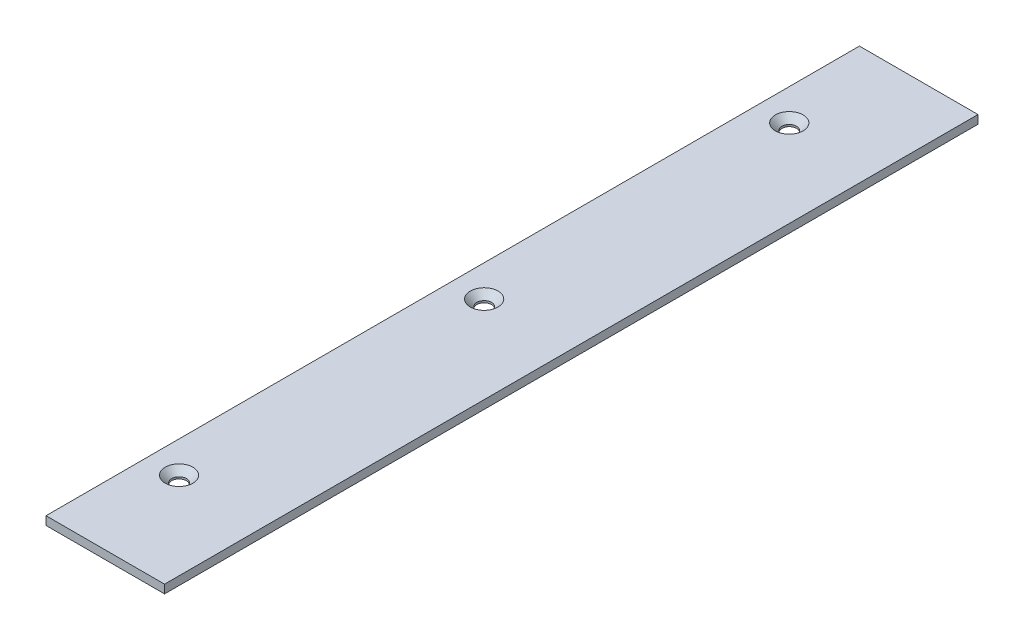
ISO-10303-21;
HEADER;
FILE_DESCRIPTION(('STEP AP214'),'2;1');
FILE_NAME('part.step','',(''),(''),'','','');
FILE_SCHEMA(('AUTOMOTIVE_DESIGN { 1 0 10303 214 1 1 1 1 }'));
ENDSEC;
DATA;
#1=APPLICATION_CONTEXT('core data for automotive mechanical design processes');
#2=APPLICATION_PROTOCOL_DEFINITION('international standard','automotive_design',2000,#1);
#3=PRODUCT_CONTEXT('',#1,'mechanical');
#4=PRODUCT('Part','Part','',(#3));
#5=PRODUCT_RELATED_PRODUCT_CATEGORY('part','',(#4));
#6=PRODUCT_DEFINITION_FORMATION('','',#4);
#7=PRODUCT_DEFINITION_CONTEXT('part definition',#1,'design');
#8=PRODUCT_DEFINITION('design','',#6,#7);
#9=PRODUCT_DEFINITION_SHAPE('','',#8);
#10=(LENGTH_UNIT() NAMED_UNIT(*) SI_UNIT(.MILLI.,.METRE.));
#11=(NAMED_UNIT(*) PLANE_ANGLE_UNIT() SI_UNIT($,.RADIAN.));
#12=(NAMED_UNIT(*) SI_UNIT($,.STERADIAN.) SOLID_ANGLE_UNIT());
#13=UNCERTAINTY_MEASURE_WITH_UNIT(LENGTH_MEASURE(1.E-05),#10,'distance_accuracy_value','');
#14=(GEOMETRIC_REPRESENTATION_CONTEXT(3) GLOBAL_UNCERTAINTY_ASSIGNED_CONTEXT((#13)) GLOBAL_UNIT_ASSIGNED_CONTEXT((#10,
#11,#12)) REPRESENTATION_CONTEXT('',''));
#15=CARTESIAN_POINT('',(0.,0.,0.));
#16=DIRECTION('',(0.,0.,1.));
#17=DIRECTION('',(1.,0.,0.));
#18=AXIS2_PLACEMENT_3D('',#15,#16,#17);
#19=CARTESIAN_POINT('',(-22.225,-1.5875,-152.5));
#20=DIRECTION('',(-1.,0.,0.));
#21=DIRECTION('',(0.,0.,1.));
#22=AXIS2_PLACEMENT_3D('',#19,#20,#21);
#23=PLANE('',#22);
#24=DIRECTION('',(0.,0.,1.));
#25=VECTOR('',#24,1.);
#26=CARTESIAN_POINT('',(-22.225,-1.5875,-152.5));
#27=LINE('',#26,#25);
#28=CARTESIAN_POINT('',(-22.225,-1.5875,-152.5));
#29=VERTEX_POINT('',#28);
#30=CARTESIAN_POINT('',(-22.225,-1.5875,152.5));
#31=VERTEX_POINT('',#30);
#32=EDGE_CURVE('E36',#29,#31,#27,.T.);
#33=ORIENTED_EDGE('',*,*,#32,.T.);
#34=DIRECTION('',(0.,-1.,0.));
#35=VECTOR('',#34,1.);
#36=CARTESIAN_POINT('',(-22.225,-1.5875,152.5));
#37=LINE('',#36,#35);
#38=CARTESIAN_POINT('',(-22.225,1.5875,152.5));
#39=VERTEX_POINT('',#38);
#40=EDGE_CURVE('E73',#39,#31,#37,.T.);
#41=ORIENTED_EDGE('',*,*,#40,.F.);
#42=DIRECTION('',(0.,0.,1.));
#43=VECTOR('',#42,1.);
#44=CARTESIAN_POINT('',(-22.225,1.5875,-152.5));
#45=LINE('',#44,#43);
#46=CARTESIAN_POINT('',(-22.225,1.5875,-152.5));
#47=VERTEX_POINT('',#46);
#48=EDGE_CURVE('E11',#47,#39,#45,.T.);
#49=ORIENTED_EDGE('',*,*,#48,.F.);
#50=DIRECTION('',(0.,-1.,0.));
#51=VECTOR('',#50,1.);
#52=CARTESIAN_POINT('',(-22.225,-1.5875,-152.5));
#53=LINE('',#52,#51);
#54=EDGE_CURVE('E74',#47,#29,#53,.T.);
#55=ORIENTED_EDGE('',*,*,#54,.T.);
#56=EDGE_LOOP('',(#33,#41,#49,#55));
#57=FACE_BOUND('',#56,.T.);
#58=ADVANCED_FACE('F33',(#57),#23,.T.);
#59=CARTESIAN_POINT('',(22.225,1.5875,-152.5));
#60=DIRECTION('',(0.,1.,0.));
#61=DIRECTION('',(-1.,0.,0.));
#62=AXIS2_PLACEMENT_3D('',#59,#60,#61);
#63=PLANE('',#62);
#64=CARTESIAN_POINT('',(-10.4394,1.5875,114.4));
#65=DIRECTION('',(0.,1.,0.));
#66=DIRECTION('',(0.,0.,1.));
#67=AXIS2_PLACEMENT_3D('',#64,#65,#66);
#68=CIRCLE('',#67,5.2);
#69=CARTESIAN_POINT('',(-10.4394,1.5875,119.6));
#70=VERTEX_POINT('',#69);
#71=EDGE_CURVE('E135',#70,#70,#68,.T.);
#72=ORIENTED_EDGE('',*,*,#71,.F.);
#73=EDGE_LOOP('',(#72));
#74=FACE_BOUND('',#73,.T.);
#75=CARTESIAN_POINT('',(-10.4394,1.5875,0.));
#76=DIRECTION('',(0.,1.,0.));
#77=DIRECTION('',(0.,0.,1.));
#78=AXIS2_PLACEMENT_3D('',#75,#76,#77);
#79=CIRCLE('',#78,5.2);
#80=CARTESIAN_POINT('',(-10.4394,1.5875,5.2));
#81=VERTEX_POINT('',#80);
#82=EDGE_CURVE('E139',#81,#81,#79,.T.);
#83=ORIENTED_EDGE('',*,*,#82,.F.);
#84=EDGE_LOOP('',(#83));
#85=FACE_BOUND('',#84,.T.);
#86=CARTESIAN_POINT('',(-10.4394,1.5875,-114.4));
#87=DIRECTION('',(0.,1.,0.));
#88=DIRECTION('',(0.,0.,1.));
#89=AXIS2_PLACEMENT_3D('',#86,#87,#88);
#90=CIRCLE('',#89,5.2);
#91=CARTESIAN_POINT('',(-10.4394,1.5875,-109.2));
#92=VERTEX_POINT('',#91);
#93=EDGE_CURVE('E142',#92,#92,#90,.T.);
#94=ORIENTED_EDGE('',*,*,#93,.F.);
#95=EDGE_LOOP('',(#94));
#96=FACE_BOUND('',#95,.T.);
#97=ORIENTED_EDGE('',*,*,#48,.T.);
#98=DIRECTION('',(-1.,0.,0.));
#99=VECTOR('',#98,1.);
#100=CARTESIAN_POINT('',(22.225,1.5875,152.5));
#101=LINE('',#100,#99);
#102=CARTESIAN_POINT('',(22.225,1.5875,152.5));
#103=VERTEX_POINT('',#102);
#104=EDGE_CURVE('E90',#103,#39,#101,.T.);
#105=ORIENTED_EDGE('',*,*,#104,.F.);
#106=DIRECTION('',(0.,0.,1.));
#107=VECTOR('',#106,1.);
#108=CARTESIAN_POINT('',(22.225,1.5875,-152.5));
#109=LINE('',#108,#107);
#110=CARTESIAN_POINT('',(22.225,1.5875,-152.5));
#111=VERTEX_POINT('',#110);
#112=EDGE_CURVE('E41',#111,#103,#109,.T.);
#113=ORIENTED_EDGE('',*,*,#112,.F.);
#114=DIRECTION('',(-1.,0.,0.));
#115=VECTOR('',#114,1.);
#116=CARTESIAN_POINT('',(22.225,1.5875,-152.5));
#117=LINE('',#116,#115);
#118=EDGE_CURVE('E79',#111,#47,#117,.T.);
#119=ORIENTED_EDGE('',*,*,#118,.T.);
#120=EDGE_LOOP('',(#97,#105,#113,#119));
#121=FACE_BOUND('',#120,.T.);
#122=ADVANCED_FACE('F110',(#74,#85,#96,#121),#63,.T.);
#123=CARTESIAN_POINT('',(22.225,-1.5875,-152.5));
#124=DIRECTION('',(1.,0.,0.));
#125=DIRECTION('',(0.,0.,-1.));
#126=AXIS2_PLACEMENT_3D('',#123,#124,#125);
#127=PLANE('',#126);
#128=ORIENTED_EDGE('',*,*,#112,.T.);
#129=DIRECTION('',(0.,1.,0.));
#130=VECTOR('',#129,1.);
#131=CARTESIAN_POINT('',(22.225,-1.5875,152.5));
#132=LINE('',#131,#130);
#133=CARTESIAN_POINT('',(22.225,-1.5875,152.5));
#134=VERTEX_POINT('',#133);
#135=EDGE_CURVE('E86',#134,#103,#132,.T.);
#136=ORIENTED_EDGE('',*,*,#135,.F.);
#137=DIRECTION('',(0.,0.,1.));
#138=VECTOR('',#137,1.);
#139=CARTESIAN_POINT('',(22.225,-1.5875,-152.5));
#140=LINE('',#139,#138);
#141=CARTESIAN_POINT('',(22.225,-1.5875,-152.5));
#142=VERTEX_POINT('',#141);
#143=EDGE_CURVE('E78',#142,#134,#140,.T.);
#144=ORIENTED_EDGE('',*,*,#143,.F.);
#145=DIRECTION('',(0.,1.,0.));
#146=VECTOR('',#145,1.);
#147=CARTESIAN_POINT('',(22.225,-1.5875,-152.5));
#148=LINE('',#147,#146);
#149=EDGE_CURVE('E103',#142,#111,#148,.T.);
#150=ORIENTED_EDGE('',*,*,#149,.T.);
#151=EDGE_LOOP('',(#128,#136,#144,#150));
#152=FACE_BOUND('',#151,.T.);
#153=ADVANCED_FACE('F107',(#152),#127,.T.);
#154=CARTESIAN_POINT('',(22.225,-1.5875,-152.5));
#155=DIRECTION('',(0.,-1.,0.));
#156=DIRECTION('',(1.,0.,0.));
#157=AXIS2_PLACEMENT_3D('',#154,#155,#156);
#158=PLANE('',#157);
#159=CARTESIAN_POINT('',(-10.4394,-1.58750000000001,114.4));
#160=DIRECTION('',(0.,1.,0.));
#161=DIRECTION('',(0.,0.,1.));
#162=AXIS2_PLACEMENT_3D('',#159,#160,#161);
#163=CIRCLE('',#162,2.75);
#164=CARTESIAN_POINT('',(-10.4394,-1.58750000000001,117.15));
#165=VERTEX_POINT('',#164);
#166=EDGE_CURVE('E154',#165,#165,#163,.T.);
#167=ORIENTED_EDGE('',*,*,#166,.T.);
#168=EDGE_LOOP('',(#167));
#169=FACE_BOUND('',#168,.T.);
#170=CARTESIAN_POINT('',(-10.4394,-1.58750000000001,0.));
#171=DIRECTION('',(0.,1.,0.));
#172=DIRECTION('',(0.,0.,1.));
#173=AXIS2_PLACEMENT_3D('',#170,#171,#172);
#174=CIRCLE('',#173,2.75);
#175=CARTESIAN_POINT('',(-10.4394,-1.58750000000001,2.75));
#176=VERTEX_POINT('',#175);
#177=EDGE_CURVE('E144',#176,#176,#174,.T.);
#178=ORIENTED_EDGE('',*,*,#177,.T.);
#179=EDGE_LOOP('',(#178));
#180=FACE_BOUND('',#179,.T.);
#181=CARTESIAN_POINT('',(-10.4394,-1.58750000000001,-114.4));
#182=DIRECTION('',(0.,1.,0.));
#183=DIRECTION('',(0.,0.,1.));
#184=AXIS2_PLACEMENT_3D('',#181,#182,#183);
#185=CIRCLE('',#184,2.75);
#186=CARTESIAN_POINT('',(-10.4394,-1.58750000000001,-111.65));
#187=VERTEX_POINT('',#186);
#188=EDGE_CURVE('E91',#187,#187,#185,.T.);
#189=ORIENTED_EDGE('',*,*,#188,.T.);
#190=EDGE_LOOP('',(#189));
#191=FACE_BOUND('',#190,.T.);
#192=ORIENTED_EDGE('',*,*,#143,.T.);
#193=DIRECTION('',(1.,0.,0.));
#194=VECTOR('',#193,1.);
#195=CARTESIAN_POINT('',(22.225,-1.5875,152.5));
#196=LINE('',#195,#194);
#197=EDGE_CURVE('E81',#31,#134,#196,.T.);
#198=ORIENTED_EDGE('',*,*,#197,.F.);
#199=ORIENTED_EDGE('',*,*,#32,.F.);
#200=DIRECTION('',(1.,0.,0.));
#201=VECTOR('',#200,1.);
#202=CARTESIAN_POINT('',(22.225,-1.5875,-152.5));
#203=LINE('',#202,#201);
#204=EDGE_CURVE('E101',#29,#142,#203,.T.);
#205=ORIENTED_EDGE('',*,*,#204,.T.);
#206=EDGE_LOOP('',(#192,#198,#199,#205));
#207=FACE_BOUND('',#206,.T.);
#208=ADVANCED_FACE('F82',(#169,#180,#191,#207),#158,.T.);
#209=CARTESIAN_POINT('',(0.,0.,-152.5));
#210=DIRECTION('',(0.,0.,1.));
#211=DIRECTION('',(1.,0.,0.));
#212=AXIS2_PLACEMENT_3D('',#209,#210,#211);
#213=PLANE('',#212);
#214=ORIENTED_EDGE('',*,*,#54,.F.);
#215=ORIENTED_EDGE('',*,*,#118,.F.);
#216=ORIENTED_EDGE('',*,*,#149,.F.);
#217=ORIENTED_EDGE('',*,*,#204,.F.);
#218=EDGE_LOOP('',(#214,#215,#216,#217));
#219=FACE_BOUND('',#218,.T.);
#220=ADVANCED_FACE('F112',(#219),#213,.F.);
#221=CARTESIAN_POINT('',(0.,0.,152.5));
#222=DIRECTION('',(0.,0.,1.));
#223=DIRECTION('',(1.,0.,0.));
#224=AXIS2_PLACEMENT_3D('',#221,#222,#223);
#225=PLANE('',#224);
#226=ORIENTED_EDGE('',*,*,#40,.T.);
#227=ORIENTED_EDGE('',*,*,#197,.T.);
#228=ORIENTED_EDGE('',*,*,#135,.T.);
#229=ORIENTED_EDGE('',*,*,#104,.T.);
#230=EDGE_LOOP('',(#226,#227,#228,#229));
#231=FACE_BOUND('',#230,.T.);
#232=ADVANCED_FACE('F89',(#231),#225,.T.);
#233=CARTESIAN_POINT('',(-10.4394,1.5875,-114.4));
#234=DIRECTION('',(0.,1.,0.));
#235=DIRECTION('',(0.,0.,1.));
#236=AXIS2_PLACEMENT_3D('',#233,#234,#235);
#237=CYLINDRICAL_SURFACE('',#236,2.75);
#238=ORIENTED_EDGE('',*,*,#188,.F.);
#239=EDGE_LOOP('',(#238));
#240=FACE_BOUND('',#239,.T.);
#241=CARTESIAN_POINT('',(-10.4394,-0.862500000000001,-114.4));
#242=DIRECTION('',(0.,1.,0.));
#243=DIRECTION('',(0.,0.,1.));
#244=AXIS2_PLACEMENT_3D('',#241,#242,#243);
#245=CIRCLE('',#244,2.75);
#246=CARTESIAN_POINT('',(-10.4394,-0.862500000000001,-111.65));
#247=VERTEX_POINT('',#246);
#248=EDGE_CURVE('E94',#247,#247,#245,.T.);
#249=ORIENTED_EDGE('',*,*,#248,.T.);
#250=EDGE_LOOP('',(#249));
#251=FACE_BOUND('',#250,.T.);
#252=ADVANCED_FACE('F119',(#240,#251),#237,.F.);
#253=CARTESIAN_POINT('',(-10.4394,1.5875,-114.4));
#254=DIRECTION('',(0.,1.,0.));
#255=DIRECTION('',(0.,0.,1.));
#256=AXIS2_PLACEMENT_3D('',#253,#254,#255);
#257=CONICAL_SURFACE('',#256,5.2,0.785398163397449);
#258=ORIENTED_EDGE('',*,*,#248,.F.);
#259=EDGE_LOOP('',(#258));
#260=FACE_BOUND('',#259,.T.);
#261=ORIENTED_EDGE('',*,*,#93,.T.);
#262=EDGE_LOOP('',(#261));
#263=FACE_BOUND('',#262,.T.);
#264=ADVANCED_FACE('F180',(#260,#263),#257,.F.);
#265=CARTESIAN_POINT('',(-10.4394,1.5875,0.));
#266=DIRECTION('',(0.,1.,0.));
#267=DIRECTION('',(0.,0.,1.));
#268=AXIS2_PLACEMENT_3D('',#265,#266,#267);
#269=CYLINDRICAL_SURFACE('',#268,2.75);
#270=ORIENTED_EDGE('',*,*,#177,.F.);
#271=EDGE_LOOP('',(#270));
#272=FACE_BOUND('',#271,.T.);
#273=CARTESIAN_POINT('',(-10.4394,-0.862500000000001,0.));
#274=DIRECTION('',(0.,1.,0.));
#275=DIRECTION('',(0.,0.,1.));
#276=AXIS2_PLACEMENT_3D('',#273,#274,#275);
#277=CIRCLE('',#276,2.75);
#278=CARTESIAN_POINT('',(-10.4394,-0.862500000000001,2.75));
#279=VERTEX_POINT('',#278);
#280=EDGE_CURVE('E148',#279,#279,#277,.T.);
#281=ORIENTED_EDGE('',*,*,#280,.T.);
#282=EDGE_LOOP('',(#281));
#283=FACE_BOUND('',#282,.T.);
#284=ADVANCED_FACE('F176',(#272,#283),#269,.F.);
#285=CARTESIAN_POINT('',(-10.4394,1.5875,0.));
#286=DIRECTION('',(0.,1.,0.));
#287=DIRECTION('',(0.,0.,1.));
#288=AXIS2_PLACEMENT_3D('',#285,#286,#287);
#289=CONICAL_SURFACE('',#288,5.2,0.785398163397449);
#290=ORIENTED_EDGE('',*,*,#280,.F.);
#291=EDGE_LOOP('',(#290));
#292=FACE_BOUND('',#291,.T.);
#293=ORIENTED_EDGE('',*,*,#82,.T.);
#294=EDGE_LOOP('',(#293));
#295=FACE_BOUND('',#294,.T.);
#296=ADVANCED_FACE('F169',(#292,#295),#289,.F.);
#297=CARTESIAN_POINT('',(-10.4394,1.5875,114.4));
#298=DIRECTION('',(0.,1.,0.));
#299=DIRECTION('',(0.,0.,1.));
#300=AXIS2_PLACEMENT_3D('',#297,#298,#299);
#301=CYLINDRICAL_SURFACE('',#300,2.75);
#302=ORIENTED_EDGE('',*,*,#166,.F.);
#303=EDGE_LOOP('',(#302));
#304=FACE_BOUND('',#303,.T.);
#305=CARTESIAN_POINT('',(-10.4394,-0.862500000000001,114.4));
#306=DIRECTION('',(0.,1.,0.));
#307=DIRECTION('',(0.,0.,1.));
#308=AXIS2_PLACEMENT_3D('',#305,#306,#307);
#309=CIRCLE('',#308,2.75);
#310=CARTESIAN_POINT('',(-10.4394,-0.862500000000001,117.15));
#311=VERTEX_POINT('',#310);
#312=EDGE_CURVE('E157',#311,#311,#309,.T.);
#313=ORIENTED_EDGE('',*,*,#312,.T.);
#314=EDGE_LOOP('',(#313));
#315=FACE_BOUND('',#314,.T.);
#316=ADVANCED_FACE('F163',(#304,#315),#301,.F.);
#317=CARTESIAN_POINT('',(-10.4394,1.5875,114.4));
#318=DIRECTION('',(0.,1.,0.));
#319=DIRECTION('',(0.,0.,1.));
#320=AXIS2_PLACEMENT_3D('',#317,#318,#319);
#321=CONICAL_SURFACE('',#320,5.2,0.785398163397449);
#322=ORIENTED_EDGE('',*,*,#312,.F.);
#323=EDGE_LOOP('',(#322));
#324=FACE_BOUND('',#323,.T.);
#325=ORIENTED_EDGE('',*,*,#71,.T.);
#326=EDGE_LOOP('',(#325));
#327=FACE_BOUND('',#326,.T.);
#328=ADVANCED_FACE('F161',(#324,#327),#321,.F.);
#329=CLOSED_SHELL('',(#58,#122,#153,#208,#220,#232,#252,#264,#284,#296,#316,#328));
#330=MANIFOLD_SOLID_BREP('B2',#329);
#331=ADVANCED_BREP_SHAPE_REPRESENTATION('',(#18,#330),#14);
#332=SHAPE_DEFINITION_REPRESENTATION(#9,#331);
ENDSEC;
END-ISO-10303-21;
